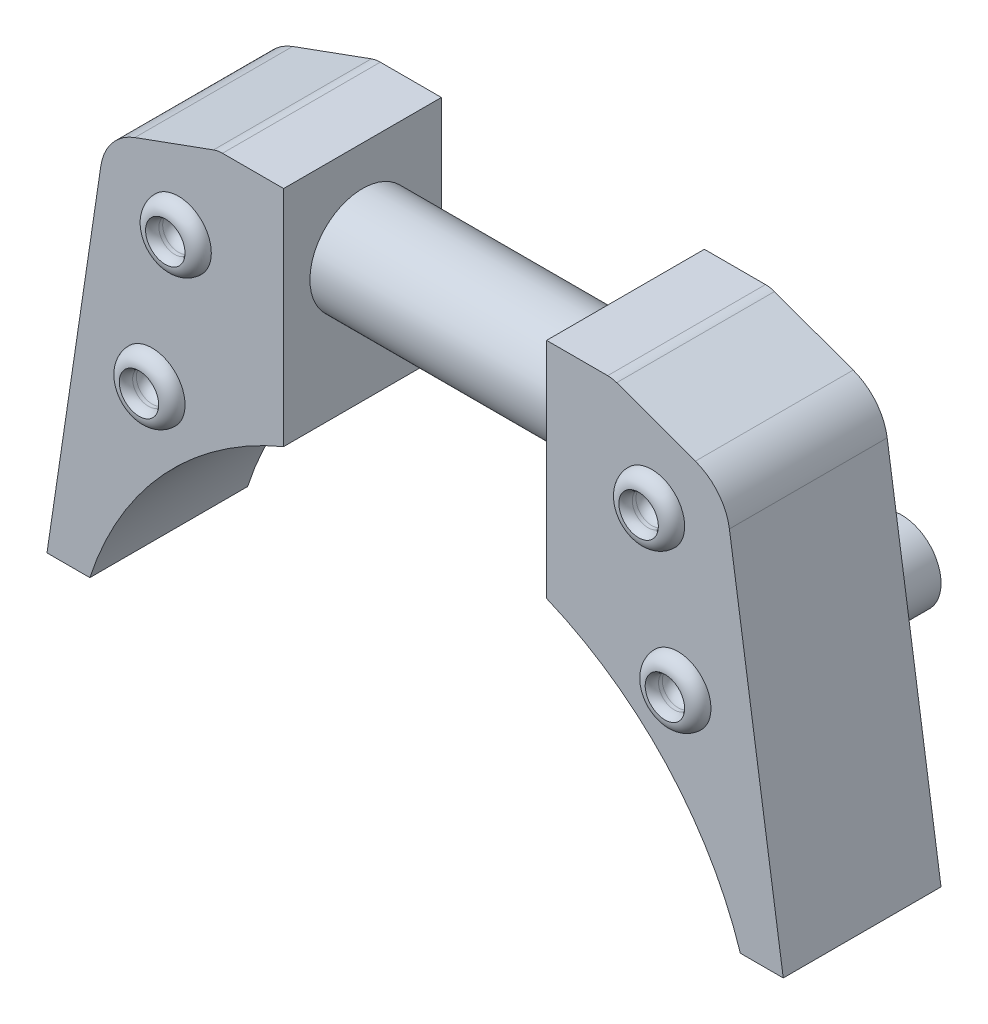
ISO-10303-21;
HEADER;
FILE_DESCRIPTION(('STEP AP214'),'2;1');
FILE_NAME('part.step','',(''),(''),'','','');
FILE_SCHEMA(('AUTOMOTIVE_DESIGN { 1 0 10303 214 1 1 1 1 }'));
ENDSEC;
DATA;
#1=APPLICATION_CONTEXT('core data for automotive mechanical design processes');
#2=APPLICATION_PROTOCOL_DEFINITION('international standard','automotive_design',2000,#1);
#3=PRODUCT_CONTEXT('',#1,'mechanical');
#4=PRODUCT('Part','Part','',(#3));
#5=PRODUCT_RELATED_PRODUCT_CATEGORY('part','',(#4));
#6=PRODUCT_DEFINITION_FORMATION('','',#4);
#7=PRODUCT_DEFINITION_CONTEXT('part definition',#1,'design');
#8=PRODUCT_DEFINITION('design','',#6,#7);
#9=PRODUCT_DEFINITION_SHAPE('','',#8);
#10=(LENGTH_UNIT() NAMED_UNIT(*) SI_UNIT(.MILLI.,.METRE.));
#11=(NAMED_UNIT(*) PLANE_ANGLE_UNIT() SI_UNIT($,.RADIAN.));
#12=(NAMED_UNIT(*) SI_UNIT($,.STERADIAN.) SOLID_ANGLE_UNIT());
#13=UNCERTAINTY_MEASURE_WITH_UNIT(LENGTH_MEASURE(1.E-05),#10,'distance_accuracy_value','');
#14=(GEOMETRIC_REPRESENTATION_CONTEXT(3) GLOBAL_UNCERTAINTY_ASSIGNED_CONTEXT((#13)) GLOBAL_UNIT_ASSIGNED_CONTEXT((#10,
#11,#12)) REPRESENTATION_CONTEXT('',''));
#15=CARTESIAN_POINT('',(0.,0.,0.));
#16=DIRECTION('',(0.,0.,1.));
#17=DIRECTION('',(1.,0.,0.));
#18=AXIS2_PLACEMENT_3D('',#15,#16,#17);
#19=CARTESIAN_POINT('',(-5.,20.5,6.));
#20=DIRECTION('',(-1.,0.,0.));
#21=DIRECTION('',(0.,-1.,0.));
#22=AXIS2_PLACEMENT_3D('',#19,#20,#21);
#23=PLANE('',#22);
#24=DIRECTION('',(0.,1.,0.));
#25=VECTOR('',#24,1.);
#26=CARTESIAN_POINT('',(-5.,20.5,0.));
#27=LINE('',#26,#25);
#28=CARTESIAN_POINT('',(-5.,12.,0.));
#29=VERTEX_POINT('',#28);
#30=CARTESIAN_POINT('',(-5.,20.5,0.));
#31=VERTEX_POINT('',#30);
#32=EDGE_CURVE('E220',#29,#31,#27,.T.);
#33=ORIENTED_EDGE('',*,*,#32,.T.);
#34=DIRECTION('',(0.,0.,-1.));
#35=VECTOR('',#34,1.);
#36=CARTESIAN_POINT('',(-5.,20.5,6.));
#37=LINE('',#36,#35);
#38=CARTESIAN_POINT('',(-5.,20.5,6.));
#39=VERTEX_POINT('',#38);
#40=EDGE_CURVE('E251',#39,#31,#37,.T.);
#41=ORIENTED_EDGE('',*,*,#40,.F.);
#42=DIRECTION('',(0.,1.,0.));
#43=VECTOR('',#42,1.);
#44=CARTESIAN_POINT('',(-5.,20.5,6.));
#45=LINE('',#44,#43);
#46=CARTESIAN_POINT('',(-5.,12.,6.));
#47=VERTEX_POINT('',#46);
#48=EDGE_CURVE('E234',#47,#39,#45,.T.);
#49=ORIENTED_EDGE('',*,*,#48,.F.);
#50=DIRECTION('',(0.,0.,-1.));
#51=VECTOR('',#50,1.);
#52=CARTESIAN_POINT('',(-5.,12.,6.));
#53=LINE('',#52,#51);
#54=EDGE_CURVE('E254',#47,#29,#53,.T.);
#55=ORIENTED_EDGE('',*,*,#54,.T.);
#56=EDGE_LOOP('',(#33,#41,#49,#55));
#57=FACE_BOUND('',#56,.T.);
#58=CARTESIAN_POINT('',(-5.,17.,3.));
#59=DIRECTION('',(-1.,0.,0.));
#60=DIRECTION('',(0.,-1.,0.));
#61=AXIS2_PLACEMENT_3D('',#58,#59,#60);
#62=CIRCLE('',#61,2.);
#63=CARTESIAN_POINT('',(-5.,15.,3.));
#64=VERTEX_POINT('',#63);
#65=EDGE_CURVE('E287',#64,#64,#62,.F.);
#66=ORIENTED_EDGE('',*,*,#65,.F.);
#67=EDGE_LOOP('',(#66));
#68=FACE_BOUND('',#67,.T.);
#69=ADVANCED_FACE('F41',(#57,#68),#23,.F.);
#70=CARTESIAN_POINT('',(0.,0.,6.));
#71=DIRECTION('',(0.,0.,1.));
#72=DIRECTION('',(1.,0.,0.));
#73=AXIS2_PLACEMENT_3D('',#70,#71,#72);
#74=PLANE('',#73);
#75=CARTESIAN_POINT('',(-10.,11.5,6.));
#76=DIRECTION('',(0.,0.,1.));
#77=DIRECTION('',(1.,0.,0.));
#78=AXIS2_PLACEMENT_3D('',#75,#76,#77);
#79=CIRCLE('',#78,1.25);
#80=CARTESIAN_POINT('',(-8.75,11.5,6.));
#81=VERTEX_POINT('',#80);
#82=EDGE_CURVE('E208',#81,#81,#79,.T.);
#83=ORIENTED_EDGE('',*,*,#82,.F.);
#84=EDGE_LOOP('',(#83));
#85=FACE_BOUND('',#84,.T.);
#86=DIRECTION('',(-1.,0.,0.));
#87=VECTOR('',#86,1.);
#88=CARTESIAN_POINT('',(-7.5,20.5,6.));
#89=LINE('',#88,#87);
#90=CARTESIAN_POINT('',(-7.32367301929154,20.5,6.));
#91=VERTEX_POINT('',#90);
#92=EDGE_CURVE('E236',#39,#91,#89,.T.);
#93=ORIENTED_EDGE('',*,*,#92,.T.);
#94=CARTESIAN_POINT('',(-7.32367301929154,19.5,6.));
#95=DIRECTION('',(0.,0.,1.));
#96=DIRECTION('',(1.,0.,0.));
#97=AXIS2_PLACEMENT_3D('',#94,#95,#96);
#98=CIRCLE('',#97,1.);
#99=CARTESIAN_POINT('',(-7.6656931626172,20.4396926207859,6.));
#100=VERTEX_POINT('',#99);
#101=EDGE_CURVE('E350',#91,#100,#98,.T.);
#102=ORIENTED_EDGE('',*,*,#101,.T.);
#103=DIRECTION('',(-0.93969262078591,-0.342020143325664,0.));
#104=VECTOR('',#103,1.);
#105=CARTESIAN_POINT('',(-7.5,20.5,6.));
#106=LINE('',#105,#104);
#107=CARTESIAN_POINT('',(-10.6579567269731,19.3505977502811,6.));
#108=VERTEX_POINT('',#107);
#109=EDGE_CURVE('E239',#100,#108,#106,.T.);
#110=ORIENTED_EDGE('',*,*,#109,.T.);
#111=CARTESIAN_POINT('',(-9.97391644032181,17.4712125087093,6.));
#112=DIRECTION('',(0.,0.,1.));
#113=DIRECTION('',(1.,0.,0.));
#114=AXIS2_PLACEMENT_3D('',#111,#112,#113);
#115=CIRCLE('',#114,2.);
#116=CARTESIAN_POINT('',(-11.9521455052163,17.7655078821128,6.));
#117=VERTEX_POINT('',#116);
#118=EDGE_CURVE('E341',#108,#117,#115,.T.);
#119=ORIENTED_EDGE('',*,*,#118,.T.);
#120=DIRECTION('',(-0.147147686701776,-0.989114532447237,0.));
#121=VECTOR('',#120,1.);
#122=CARTESIAN_POINT('',(-14.,4.,6.));
#123=LINE('',#122,#121);
#124=CARTESIAN_POINT('',(-14.,4.,6.));
#125=VERTEX_POINT('',#124);
#126=EDGE_CURVE('E241',#117,#125,#123,.T.);
#127=ORIENTED_EDGE('',*,*,#126,.T.);
#128=DIRECTION('',(1.,0.,0.));
#129=VECTOR('',#128,1.);
#130=CARTESIAN_POINT('',(-14.,4.,6.));
#131=LINE('',#130,#129);
#132=CARTESIAN_POINT('',(-12.369316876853,4.,6.));
#133=VERTEX_POINT('',#132);
#134=EDGE_CURVE('E243',#125,#133,#131,.T.);
#135=ORIENTED_EDGE('',*,*,#134,.T.);
#136=CARTESIAN_POINT('',(0.,0.,6.));
#137=DIRECTION('',(0.,0.,-1.));
#138=DIRECTION('',(1.,0.,0.));
#139=AXIS2_PLACEMENT_3D('',#136,#137,#138);
#140=CIRCLE('',#139,13.);
#141=EDGE_CURVE('E231',#133,#47,#140,.T.);
#142=ORIENTED_EDGE('',*,*,#141,.T.);
#143=ORIENTED_EDGE('',*,*,#48,.T.);
#144=EDGE_LOOP('',(#93,#102,#110,#119,#127,#135,#142,#143));
#145=FACE_BOUND('',#144,.T.);
#146=CARTESIAN_POINT('',(-9.,17.,6.));
#147=DIRECTION('',(0.,0.,1.));
#148=DIRECTION('',(1.,0.,0.));
#149=AXIS2_PLACEMENT_3D('',#146,#147,#148);
#150=CIRCLE('',#149,1.25);
#151=CARTESIAN_POINT('',(-7.75,17.,6.));
#152=VERTEX_POINT('',#151);
#153=EDGE_CURVE('E205',#152,#152,#150,.T.);
#154=ORIENTED_EDGE('',*,*,#153,.F.);
#155=EDGE_LOOP('',(#154));
#156=FACE_BOUND('',#155,.T.);
#157=ADVANCED_FACE('F379',(#85,#145,#156),#74,.T.);
#158=CARTESIAN_POINT('',(0.,0.,0.));
#159=DIRECTION('',(0.,0.,1.));
#160=DIRECTION('',(1.,0.,0.));
#161=AXIS2_PLACEMENT_3D('',#158,#159,#160);
#162=PLANE('',#161);
#163=CARTESIAN_POINT('',(-10.,11.5,0.));
#164=DIRECTION('',(0.,0.,1.));
#165=DIRECTION('',(1.,0.,0.));
#166=AXIS2_PLACEMENT_3D('',#163,#164,#165);
#167=CIRCLE('',#166,1.5);
#168=CARTESIAN_POINT('',(-8.5,11.5,0.));
#169=VERTEX_POINT('',#168);
#170=EDGE_CURVE('E257',#169,#169,#167,.F.);
#171=ORIENTED_EDGE('',*,*,#170,.F.);
#172=EDGE_LOOP('',(#171));
#173=FACE_BOUND('',#172,.T.);
#174=DIRECTION('',(-0.93969262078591,-0.342020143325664,0.));
#175=VECTOR('',#174,1.);
#176=CARTESIAN_POINT('',(-7.5,20.5,0.));
#177=LINE('',#176,#175);
#178=CARTESIAN_POINT('',(-7.6656931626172,20.4396926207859,0.));
#179=VERTEX_POINT('',#178);
#180=CARTESIAN_POINT('',(-10.6579567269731,19.3505977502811,0.));
#181=VERTEX_POINT('',#180);
#182=EDGE_CURVE('E225',#179,#181,#177,.T.);
#183=ORIENTED_EDGE('',*,*,#182,.F.);
#184=CARTESIAN_POINT('',(-7.32367301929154,19.5,0.));
#185=DIRECTION('',(0.,0.,1.));
#186=DIRECTION('',(1.,0.,0.));
#187=AXIS2_PLACEMENT_3D('',#184,#185,#186);
#188=CIRCLE('',#187,1.);
#189=CARTESIAN_POINT('',(-7.32367301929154,20.5,0.));
#190=VERTEX_POINT('',#189);
#191=EDGE_CURVE('E346',#179,#190,#188,.F.);
#192=ORIENTED_EDGE('',*,*,#191,.T.);
#193=DIRECTION('',(-1.,0.,0.));
#194=VECTOR('',#193,1.);
#195=CARTESIAN_POINT('',(-7.5,20.5,0.));
#196=LINE('',#195,#194);
#197=EDGE_CURVE('E222',#31,#190,#196,.T.);
#198=ORIENTED_EDGE('',*,*,#197,.F.);
#199=ORIENTED_EDGE('',*,*,#32,.F.);
#200=CARTESIAN_POINT('',(0.,0.,0.));
#201=DIRECTION('',(0.,0.,-1.));
#202=DIRECTION('',(1.,0.,0.));
#203=AXIS2_PLACEMENT_3D('',#200,#201,#202);
#204=CIRCLE('',#203,13.);
#205=CARTESIAN_POINT('',(-12.369316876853,4.,0.));
#206=VERTEX_POINT('',#205);
#207=EDGE_CURVE('E217',#206,#29,#204,.T.);
#208=ORIENTED_EDGE('',*,*,#207,.F.);
#209=DIRECTION('',(1.,0.,0.));
#210=VECTOR('',#209,1.);
#211=CARTESIAN_POINT('',(-14.,4.,0.));
#212=LINE('',#211,#210);
#213=CARTESIAN_POINT('',(-14.,4.,0.));
#214=VERTEX_POINT('',#213);
#215=EDGE_CURVE('E229',#214,#206,#212,.T.);
#216=ORIENTED_EDGE('',*,*,#215,.F.);
#217=DIRECTION('',(-0.147147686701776,-0.989114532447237,0.));
#218=VECTOR('',#217,1.);
#219=CARTESIAN_POINT('',(-14.,4.,0.));
#220=LINE('',#219,#218);
#221=CARTESIAN_POINT('',(-11.9521455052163,17.7655078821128,0.));
#222=VERTEX_POINT('',#221);
#223=EDGE_CURVE('E227',#222,#214,#220,.T.);
#224=ORIENTED_EDGE('',*,*,#223,.F.);
#225=CARTESIAN_POINT('',(-9.97391644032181,17.4712125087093,0.));
#226=DIRECTION('',(0.,0.,1.));
#227=DIRECTION('',(1.,0.,0.));
#228=AXIS2_PLACEMENT_3D('',#225,#226,#227);
#229=CIRCLE('',#228,2.);
#230=EDGE_CURVE('E335',#222,#181,#229,.F.);
#231=ORIENTED_EDGE('',*,*,#230,.T.);
#232=EDGE_LOOP('',(#183,#192,#198,#199,#208,#216,#224,#231));
#233=FACE_BOUND('',#232,.T.);
#234=CARTESIAN_POINT('',(-9.,17.,0.));
#235=DIRECTION('',(0.,0.,1.));
#236=DIRECTION('',(1.,0.,0.));
#237=AXIS2_PLACEMENT_3D('',#234,#235,#236);
#238=CIRCLE('',#237,1.5);
#239=CARTESIAN_POINT('',(-7.5,17.,0.));
#240=VERTEX_POINT('',#239);
#241=EDGE_CURVE('E260',#240,#240,#238,.F.);
#242=ORIENTED_EDGE('',*,*,#241,.F.);
#243=EDGE_LOOP('',(#242));
#244=FACE_BOUND('',#243,.T.);
#245=ADVANCED_FACE('F384',(#173,#233,#244),#162,.F.);
#246=CARTESIAN_POINT('',(0.,0.,6.));
#247=DIRECTION('',(0.,0.,-1.));
#248=DIRECTION('',(-1.,0.,0.));
#249=AXIS2_PLACEMENT_3D('',#246,#247,#248);
#250=CYLINDRICAL_SURFACE('',#249,13.);
#251=ORIENTED_EDGE('',*,*,#207,.T.);
#252=ORIENTED_EDGE('',*,*,#54,.F.);
#253=ORIENTED_EDGE('',*,*,#141,.F.);
#254=DIRECTION('',(0.,0.,-1.));
#255=VECTOR('',#254,1.);
#256=CARTESIAN_POINT('',(-12.369316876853,4.,6.));
#257=LINE('',#256,#255);
#258=EDGE_CURVE('E245',#133,#206,#257,.T.);
#259=ORIENTED_EDGE('',*,*,#258,.T.);
#260=EDGE_LOOP('',(#251,#252,#253,#259));
#261=FACE_BOUND('',#260,.T.);
#262=ADVANCED_FACE('F43',(#261),#250,.F.);
#263=CARTESIAN_POINT('',(-7.5,20.5,6.));
#264=DIRECTION('',(0.,-1.,0.));
#265=DIRECTION('',(0.,0.,-1.));
#266=AXIS2_PLACEMENT_3D('',#263,#264,#265);
#267=PLANE('',#266);
#268=ORIENTED_EDGE('',*,*,#197,.T.);
#269=DIRECTION('',(0.,0.,-1.));
#270=VECTOR('',#269,1.);
#271=CARTESIAN_POINT('',(-7.32367301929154,20.5,6.));
#272=LINE('',#271,#270);
#273=EDGE_CURVE('E348',#190,#91,#272,.F.);
#274=ORIENTED_EDGE('',*,*,#273,.T.);
#275=ORIENTED_EDGE('',*,*,#92,.F.);
#276=ORIENTED_EDGE('',*,*,#40,.T.);
#277=EDGE_LOOP('',(#268,#274,#275,#276));
#278=FACE_BOUND('',#277,.T.);
#279=ADVANCED_FACE('F389',(#278),#267,.F.);
#280=CARTESIAN_POINT('',(-7.5,20.5,6.));
#281=DIRECTION('',(0.342020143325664,-0.93969262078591,0.));
#282=DIRECTION('',(0.93969262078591,0.342020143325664,0.));
#283=AXIS2_PLACEMENT_3D('',#280,#281,#282);
#284=PLANE('',#283);
#285=ORIENTED_EDGE('',*,*,#109,.F.);
#286=DIRECTION('',(0.,0.,-1.));
#287=VECTOR('',#286,1.);
#288=CARTESIAN_POINT('',(-7.6656931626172,20.4396926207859,6.));
#289=LINE('',#288,#287);
#290=EDGE_CURVE('E343',#100,#179,#289,.T.);
#291=ORIENTED_EDGE('',*,*,#290,.T.);
#292=ORIENTED_EDGE('',*,*,#182,.T.);
#293=DIRECTION('',(0.,0.,-1.));
#294=VECTOR('',#293,1.);
#295=CARTESIAN_POINT('',(-10.6579567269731,19.3505977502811,6.));
#296=LINE('',#295,#294);
#297=EDGE_CURVE('E338',#181,#108,#296,.F.);
#298=ORIENTED_EDGE('',*,*,#297,.T.);
#299=EDGE_LOOP('',(#285,#291,#292,#298));
#300=FACE_BOUND('',#299,.T.);
#301=ADVANCED_FACE('F392',(#300),#284,.F.);
#302=CARTESIAN_POINT('',(-14.,4.,6.));
#303=DIRECTION('',(0.989114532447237,-0.147147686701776,0.));
#304=DIRECTION('',(0.147147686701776,0.989114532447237,0.));
#305=AXIS2_PLACEMENT_3D('',#302,#303,#304);
#306=PLANE('',#305);
#307=ORIENTED_EDGE('',*,*,#126,.F.);
#308=DIRECTION('',(0.,0.,-1.));
#309=VECTOR('',#308,1.);
#310=CARTESIAN_POINT('',(-11.9521455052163,17.7655078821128,6.));
#311=LINE('',#310,#309);
#312=EDGE_CURVE('E332',#117,#222,#311,.T.);
#313=ORIENTED_EDGE('',*,*,#312,.T.);
#314=ORIENTED_EDGE('',*,*,#223,.T.);
#315=DIRECTION('',(0.,0.,-1.));
#316=VECTOR('',#315,1.);
#317=CARTESIAN_POINT('',(-14.,4.,6.));
#318=LINE('',#317,#316);
#319=EDGE_CURVE('E248',#125,#214,#318,.T.);
#320=ORIENTED_EDGE('',*,*,#319,.F.);
#321=EDGE_LOOP('',(#307,#313,#314,#320));
#322=FACE_BOUND('',#321,.T.);
#323=ADVANCED_FACE('F396',(#322),#306,.F.);
#324=CARTESIAN_POINT('',(-14.,4.,6.));
#325=DIRECTION('',(0.,1.,0.));
#326=DIRECTION('',(0.,0.,1.));
#327=AXIS2_PLACEMENT_3D('',#324,#325,#326);
#328=PLANE('',#327);
#329=ORIENTED_EDGE('',*,*,#215,.T.);
#330=ORIENTED_EDGE('',*,*,#258,.F.);
#331=ORIENTED_EDGE('',*,*,#134,.F.);
#332=ORIENTED_EDGE('',*,*,#319,.T.);
#333=EDGE_LOOP('',(#329,#330,#331,#332));
#334=FACE_BOUND('',#333,.T.);
#335=ADVANCED_FACE('F400',(#334),#328,.F.);
#336=CARTESIAN_POINT('',(-10.,11.5,-2.5));
#337=DIRECTION('',(0.,0.,1.));
#338=DIRECTION('',(1.,0.,0.));
#339=AXIS2_PLACEMENT_3D('',#336,#337,#338);
#340=CYLINDRICAL_SURFACE('',#339,1.5);
#341=CARTESIAN_POINT('',(-10.,11.5,-2.5));
#342=DIRECTION('',(0.,0.,-1.));
#343=DIRECTION('',(-1.,0.,0.));
#344=AXIS2_PLACEMENT_3D('',#341,#342,#343);
#345=CIRCLE('',#344,1.5);
#346=CARTESIAN_POINT('',(-11.5,11.5,-2.5));
#347=VERTEX_POINT('',#346);
#348=EDGE_CURVE('E214',#347,#347,#345,.T.);
#349=ORIENTED_EDGE('',*,*,#348,.F.);
#350=EDGE_LOOP('',(#349));
#351=FACE_BOUND('',#350,.T.);
#352=ORIENTED_EDGE('',*,*,#170,.T.);
#353=EDGE_LOOP('',(#352));
#354=FACE_BOUND('',#353,.T.);
#355=ADVANCED_FACE('F403',(#351,#354),#340,.T.);
#356=CARTESIAN_POINT('',(-10.,11.5,-2.5));
#357=DIRECTION('',(0.,0.,-1.));
#358=DIRECTION('',(-1.,0.,0.));
#359=AXIS2_PLACEMENT_3D('',#356,#357,#358);
#360=PLANE('',#359);
#361=ORIENTED_EDGE('',*,*,#348,.T.);
#362=EDGE_LOOP('',(#361));
#363=FACE_BOUND('',#362,.T.);
#364=ADVANCED_FACE('F411',(#363),#360,.T.);
#365=CARTESIAN_POINT('',(-9.,17.,-1.));
#366=DIRECTION('',(0.,0.,1.));
#367=DIRECTION('',(1.,0.,0.));
#368=AXIS2_PLACEMENT_3D('',#365,#366,#367);
#369=CYLINDRICAL_SURFACE('',#368,1.5);
#370=CARTESIAN_POINT('',(-9.,17.,-1.));
#371=DIRECTION('',(0.,0.,-1.));
#372=DIRECTION('',(-1.,0.,0.));
#373=AXIS2_PLACEMENT_3D('',#370,#371,#372);
#374=CIRCLE('',#373,1.5);
#375=CARTESIAN_POINT('',(-10.5,17.,-1.));
#376=VERTEX_POINT('',#375);
#377=EDGE_CURVE('E211',#376,#376,#374,.T.);
#378=ORIENTED_EDGE('',*,*,#377,.F.);
#379=EDGE_LOOP('',(#378));
#380=FACE_BOUND('',#379,.T.);
#381=ORIENTED_EDGE('',*,*,#241,.T.);
#382=EDGE_LOOP('',(#381));
#383=FACE_BOUND('',#382,.T.);
#384=ADVANCED_FACE('F415',(#380,#383),#369,.T.);
#385=CARTESIAN_POINT('',(-9.,17.,-1.));
#386=DIRECTION('',(0.,0.,-1.));
#387=DIRECTION('',(-1.,0.,0.));
#388=AXIS2_PLACEMENT_3D('',#385,#386,#387);
#389=PLANE('',#388);
#390=ORIENTED_EDGE('',*,*,#377,.T.);
#391=EDGE_LOOP('',(#390));
#392=FACE_BOUND('',#391,.T.);
#393=ADVANCED_FACE('F419',(#392),#389,.T.);
#394=CARTESIAN_POINT('',(-9.,17.,5.5));
#395=DIRECTION('',(0.,0.,1.));
#396=DIRECTION('',(1.,0.,0.));
#397=AXIS2_PLACEMENT_3D('',#394,#395,#396);
#398=CYLINDRICAL_SURFACE('',#397,0.6);
#399=CARTESIAN_POINT('',(-9.,17.,6.14292857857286));
#400=DIRECTION('',(0.,0.,1.));
#401=DIRECTION('',(1.,0.,0.));
#402=AXIS2_PLACEMENT_3D('',#399,#400,#401);
#403=CIRCLE('',#402,0.6);
#404=CARTESIAN_POINT('',(-8.4,17.,6.14292857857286));
#405=VERTEX_POINT('',#404);
#406=EDGE_CURVE('E281',#405,#405,#403,.T.);
#407=ORIENTED_EDGE('',*,*,#406,.T.);
#408=EDGE_LOOP('',(#407));
#409=FACE_BOUND('',#408,.T.);
#410=CARTESIAN_POINT('',(-9.,17.,6.));
#411=DIRECTION('',(0.,0.,1.));
#412=DIRECTION('',(1.,0.,0.));
#413=AXIS2_PLACEMENT_3D('',#410,#411,#412);
#414=CIRCLE('',#413,0.6);
#415=CARTESIAN_POINT('',(-8.4,17.,6.));
#416=VERTEX_POINT('',#415);
#417=EDGE_CURVE('E278',#416,#416,#414,.F.);
#418=ORIENTED_EDGE('',*,*,#417,.T.);
#419=EDGE_LOOP('',(#418));
#420=FACE_BOUND('',#419,.T.);
#421=ADVANCED_FACE('F423',(#409,#420),#398,.F.);
#422=CARTESIAN_POINT('',(-9.,17.,5.5));
#423=DIRECTION('',(0.,0.,1.));
#424=DIRECTION('',(1.,0.,0.));
#425=AXIS2_PLACEMENT_3D('',#422,#423,#424);
#426=PLANE('',#425);
#427=CARTESIAN_POINT('',(-9.,17.,5.5));
#428=DIRECTION('',(0.,0.,1.));
#429=DIRECTION('',(1.,0.,0.));
#430=AXIS2_PLACEMENT_3D('',#427,#428,#429);
#431=CIRCLE('',#430,0.1);
#432=CARTESIAN_POINT('',(-8.9,17.,5.5));
#433=VERTEX_POINT('',#432);
#434=EDGE_CURVE('E284',#433,#433,#431,.T.);
#435=ORIENTED_EDGE('',*,*,#434,.T.);
#436=EDGE_LOOP('',(#435));
#437=FACE_BOUND('',#436,.T.);
#438=ADVANCED_FACE('F427',(#437),#426,.T.);
#439=CARTESIAN_POINT('',(-10.,11.5,5.5));
#440=DIRECTION('',(0.,0.,1.));
#441=DIRECTION('',(1.,0.,0.));
#442=AXIS2_PLACEMENT_3D('',#439,#440,#441);
#443=CYLINDRICAL_SURFACE('',#442,0.6);
#444=CARTESIAN_POINT('',(-10.,11.5,6.14292857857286));
#445=DIRECTION('',(0.,0.,1.));
#446=DIRECTION('',(1.,0.,0.));
#447=AXIS2_PLACEMENT_3D('',#444,#445,#446);
#448=CIRCLE('',#447,0.6);
#449=CARTESIAN_POINT('',(-9.4,11.5,6.14292857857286));
#450=VERTEX_POINT('',#449);
#451=EDGE_CURVE('E272',#450,#450,#448,.T.);
#452=ORIENTED_EDGE('',*,*,#451,.T.);
#453=EDGE_LOOP('',(#452));
#454=FACE_BOUND('',#453,.T.);
#455=CARTESIAN_POINT('',(-10.,11.5,6.));
#456=DIRECTION('',(0.,0.,1.));
#457=DIRECTION('',(1.,0.,0.));
#458=AXIS2_PLACEMENT_3D('',#455,#456,#457);
#459=CIRCLE('',#458,0.6);
#460=CARTESIAN_POINT('',(-9.4,11.5,6.));
#461=VERTEX_POINT('',#460);
#462=EDGE_CURVE('E269',#461,#461,#459,.F.);
#463=ORIENTED_EDGE('',*,*,#462,.T.);
#464=EDGE_LOOP('',(#463));
#465=FACE_BOUND('',#464,.T.);
#466=ADVANCED_FACE('F431',(#454,#465),#443,.F.);
#467=CARTESIAN_POINT('',(-10.,11.5,5.5));
#468=DIRECTION('',(0.,0.,1.));
#469=DIRECTION('',(1.,0.,0.));
#470=AXIS2_PLACEMENT_3D('',#467,#468,#469);
#471=PLANE('',#470);
#472=CARTESIAN_POINT('',(-10.,11.5,5.5));
#473=DIRECTION('',(0.,0.,1.));
#474=DIRECTION('',(1.,0.,0.));
#475=AXIS2_PLACEMENT_3D('',#472,#473,#474);
#476=CIRCLE('',#475,0.1);
#477=CARTESIAN_POINT('',(-9.9,11.5,5.5));
#478=VERTEX_POINT('',#477);
#479=EDGE_CURVE('E275',#478,#478,#476,.T.);
#480=ORIENTED_EDGE('',*,*,#479,.T.);
#481=EDGE_LOOP('',(#480));
#482=FACE_BOUND('',#481,.T.);
#483=ADVANCED_FACE('F435',(#482),#471,.T.);
#484=CARTESIAN_POINT('',(-9.,17.,6.));
#485=DIRECTION('',(0.,0.,1.));
#486=DIRECTION('',(1.,0.,0.));
#487=AXIS2_PLACEMENT_3D('',#484,#485,#486);
#488=TOROIDAL_SURFACE('',#487,0.75,0.5);
#489=ORIENTED_EDGE('',*,*,#153,.T.);
#490=EDGE_LOOP('',(#489));
#491=FACE_BOUND('',#490,.T.);
#492=CARTESIAN_POINT('',(-9.,17.,6.5));
#493=DIRECTION('',(0.,0.,1.));
#494=DIRECTION('',(1.,0.,0.));
#495=AXIS2_PLACEMENT_3D('',#492,#493,#494);
#496=CIRCLE('',#495,0.75);
#497=CARTESIAN_POINT('',(-8.25,17.,6.5));
#498=VERTEX_POINT('',#497);
#499=EDGE_CURVE('E263',#498,#498,#496,.T.);
#500=ORIENTED_EDGE('',*,*,#499,.F.);
#501=EDGE_LOOP('',(#500));
#502=FACE_BOUND('',#501,.T.);
#503=ADVANCED_FACE('F439',(#491,#502),#488,.T.);
#504=CARTESIAN_POINT('',(-10.,11.5,6.));
#505=DIRECTION('',(0.,0.,1.));
#506=DIRECTION('',(1.,0.,0.));
#507=AXIS2_PLACEMENT_3D('',#504,#505,#506);
#508=TOROIDAL_SURFACE('',#507,0.749999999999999,0.5);
#509=ORIENTED_EDGE('',*,*,#82,.T.);
#510=EDGE_LOOP('',(#509));
#511=FACE_BOUND('',#510,.T.);
#512=CARTESIAN_POINT('',(-10.,11.5,6.5));
#513=DIRECTION('',(0.,0.,1.));
#514=DIRECTION('',(1.,0.,0.));
#515=AXIS2_PLACEMENT_3D('',#512,#513,#514);
#516=CIRCLE('',#515,0.749999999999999);
#517=CARTESIAN_POINT('',(-9.25,11.5,6.5));
#518=VERTEX_POINT('',#517);
#519=EDGE_CURVE('E266',#518,#518,#516,.T.);
#520=ORIENTED_EDGE('',*,*,#519,.F.);
#521=EDGE_LOOP('',(#520));
#522=FACE_BOUND('',#521,.T.);
#523=ADVANCED_FACE('F443',(#511,#522),#508,.T.);
#524=CARTESIAN_POINT('',(-10.,11.5,6.14292857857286));
#525=DIRECTION('',(0.,0.,1.));
#526=DIRECTION('',(1.,0.,0.));
#527=AXIS2_PLACEMENT_3D('',#524,#525,#526);
#528=TOROIDAL_SURFACE('',#527,1.1,0.5);
#529=ORIENTED_EDGE('',*,*,#519,.T.);
#530=EDGE_LOOP('',(#529));
#531=FACE_BOUND('',#530,.T.);
#532=ORIENTED_EDGE('',*,*,#451,.F.);
#533=EDGE_LOOP('',(#532));
#534=FACE_BOUND('',#533,.T.);
#535=ADVANCED_FACE('F447',(#531,#534),#528,.T.);
#536=CARTESIAN_POINT('',(-10.,11.5,6.));
#537=DIRECTION('',(0.,0.,1.));
#538=DIRECTION('',(1.,0.,0.));
#539=AXIS2_PLACEMENT_3D('',#536,#537,#538);
#540=DEGENERATE_TOROIDAL_SURFACE('',#539,0.1,0.5,.T.);
#541=ORIENTED_EDGE('',*,*,#462,.F.);
#542=EDGE_LOOP('',(#541));
#543=FACE_BOUND('',#542,.T.);
#544=ORIENTED_EDGE('',*,*,#479,.F.);
#545=EDGE_LOOP('',(#544));
#546=FACE_BOUND('',#545,.T.);
#547=ADVANCED_FACE('F451',(#543,#546),#540,.F.);
#548=CARTESIAN_POINT('',(-9.,17.,6.14292857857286));
#549=DIRECTION('',(0.,0.,1.));
#550=DIRECTION('',(1.,0.,0.));
#551=AXIS2_PLACEMENT_3D('',#548,#549,#550);
#552=TOROIDAL_SURFACE('',#551,1.1,0.5);
#553=ORIENTED_EDGE('',*,*,#499,.T.);
#554=EDGE_LOOP('',(#553));
#555=FACE_BOUND('',#554,.T.);
#556=ORIENTED_EDGE('',*,*,#406,.F.);
#557=EDGE_LOOP('',(#556));
#558=FACE_BOUND('',#557,.T.);
#559=ADVANCED_FACE('F455',(#555,#558),#552,.T.);
#560=CARTESIAN_POINT('',(-9.,17.,6.));
#561=DIRECTION('',(0.,0.,1.));
#562=DIRECTION('',(1.,0.,0.));
#563=AXIS2_PLACEMENT_3D('',#560,#561,#562);
#564=DEGENERATE_TOROIDAL_SURFACE('',#563,0.1,0.5,.T.);
#565=ORIENTED_EDGE('',*,*,#417,.F.);
#566=EDGE_LOOP('',(#565));
#567=FACE_BOUND('',#566,.T.);
#568=ORIENTED_EDGE('',*,*,#434,.F.);
#569=EDGE_LOOP('',(#568));
#570=FACE_BOUND('',#569,.T.);
#571=ADVANCED_FACE('F459',(#567,#570),#564,.F.);
#572=CARTESIAN_POINT('',(7.,17.,3.));
#573=DIRECTION('',(-1.,0.,0.));
#574=DIRECTION('',(0.,-1.,0.));
#575=AXIS2_PLACEMENT_3D('',#572,#573,#574);
#576=CYLINDRICAL_SURFACE('',#575,2.);
#577=CARTESIAN_POINT('',(5.,17.,3.));
#578=DIRECTION('',(-1.,0.,0.));
#579=DIRECTION('',(0.,-1.,0.));
#580=AXIS2_PLACEMENT_3D('',#577,#578,#579);
#581=CIRCLE('',#580,2.);
#582=CARTESIAN_POINT('',(5.,15.,3.));
#583=VERTEX_POINT('',#582);
#584=EDGE_CURVE('E163',#583,#583,#581,.T.);
#585=ORIENTED_EDGE('',*,*,#584,.T.);
#586=EDGE_LOOP('',(#585));
#587=FACE_BOUND('',#586,.T.);
#588=ORIENTED_EDGE('',*,*,#65,.T.);
#589=EDGE_LOOP('',(#588));
#590=FACE_BOUND('',#589,.T.);
#591=ADVANCED_FACE('F463',(#587,#590),#576,.T.);
#592=CARTESIAN_POINT('',(5.,20.5,6.));
#593=DIRECTION('',(-1.,0.,0.));
#594=DIRECTION('',(0.,-1.,0.));
#595=AXIS2_PLACEMENT_3D('',#592,#593,#594);
#596=PLANE('',#595);
#597=DIRECTION('',(0.,1.,0.));
#598=VECTOR('',#597,1.);
#599=CARTESIAN_POINT('',(5.,20.5,0.));
#600=LINE('',#599,#598);
#601=CARTESIAN_POINT('',(5.,12.,0.));
#602=VERTEX_POINT('',#601);
#603=CARTESIAN_POINT('',(5.,20.5,0.));
#604=VERTEX_POINT('',#603);
#605=EDGE_CURVE('E186',#602,#604,#600,.T.);
#606=ORIENTED_EDGE('',*,*,#605,.F.);
#607=DIRECTION('',(0.,0.,-1.));
#608=VECTOR('',#607,1.);
#609=CARTESIAN_POINT('',(5.,12.,6.));
#610=LINE('',#609,#608);
#611=CARTESIAN_POINT('',(5.,12.,6.));
#612=VERTEX_POINT('',#611);
#613=EDGE_CURVE('E169',#612,#602,#610,.T.);
#614=ORIENTED_EDGE('',*,*,#613,.F.);
#615=DIRECTION('',(0.,1.,0.));
#616=VECTOR('',#615,1.);
#617=CARTESIAN_POINT('',(5.,20.5,6.));
#618=LINE('',#617,#616);
#619=CARTESIAN_POINT('',(5.,20.5,6.));
#620=VERTEX_POINT('',#619);
#621=EDGE_CURVE('E198',#612,#620,#618,.T.);
#622=ORIENTED_EDGE('',*,*,#621,.T.);
#623=DIRECTION('',(0.,0.,-1.));
#624=VECTOR('',#623,1.);
#625=CARTESIAN_POINT('',(5.,20.5,6.));
#626=LINE('',#625,#624);
#627=EDGE_CURVE('E202',#620,#604,#626,.T.);
#628=ORIENTED_EDGE('',*,*,#627,.T.);
#629=EDGE_LOOP('',(#606,#614,#622,#628));
#630=FACE_BOUND('',#629,.T.);
#631=ORIENTED_EDGE('',*,*,#584,.F.);
#632=EDGE_LOOP('',(#631));
#633=FACE_BOUND('',#632,.T.);
#634=ADVANCED_FACE('F363',(#630,#633),#596,.T.);
#635=CARTESIAN_POINT('',(0.,0.,6.));
#636=DIRECTION('',(0.,0.,-1.));
#637=DIRECTION('',(-1.,0.,0.));
#638=AXIS2_PLACEMENT_3D('',#635,#636,#637);
#639=CYLINDRICAL_SURFACE('',#638,13.);
#640=CARTESIAN_POINT('',(0.,0.,0.));
#641=DIRECTION('',(0.,0.,1.));
#642=DIRECTION('',(-1.,0.,0.));
#643=AXIS2_PLACEMENT_3D('',#640,#641,#642);
#644=CIRCLE('',#643,13.);
#645=CARTESIAN_POINT('',(12.369316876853,4.,0.));
#646=VERTEX_POINT('',#645);
#647=EDGE_CURVE('E167',#646,#602,#644,.T.);
#648=ORIENTED_EDGE('',*,*,#647,.F.);
#649=DIRECTION('',(0.,0.,-1.));
#650=VECTOR('',#649,1.);
#651=CARTESIAN_POINT('',(12.369316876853,4.,6.));
#652=LINE('',#651,#650);
#653=CARTESIAN_POINT('',(12.369316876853,4.,6.));
#654=VERTEX_POINT('',#653);
#655=EDGE_CURVE('E152',#654,#646,#652,.T.);
#656=ORIENTED_EDGE('',*,*,#655,.F.);
#657=CARTESIAN_POINT('',(0.,0.,6.));
#658=DIRECTION('',(0.,0.,1.));
#659=DIRECTION('',(-1.,0.,0.));
#660=AXIS2_PLACEMENT_3D('',#657,#658,#659);
#661=CIRCLE('',#660,13.);
#662=EDGE_CURVE('E188',#654,#612,#661,.T.);
#663=ORIENTED_EDGE('',*,*,#662,.T.);
#664=ORIENTED_EDGE('',*,*,#613,.T.);
#665=EDGE_LOOP('',(#648,#656,#663,#664));
#666=FACE_BOUND('',#665,.T.);
#667=ADVANCED_FACE('F168',(#666),#639,.F.);
#668=CARTESIAN_POINT('',(14.,4.,6.));
#669=DIRECTION('',(0.,-1.,0.));
#670=DIRECTION('',(0.,0.,-1.));
#671=AXIS2_PLACEMENT_3D('',#668,#669,#670);
#672=PLANE('',#671);
#673=DIRECTION('',(-1.,0.,0.));
#674=VECTOR('',#673,1.);
#675=CARTESIAN_POINT('',(14.,4.,0.));
#676=LINE('',#675,#674);
#677=CARTESIAN_POINT('',(14.,4.,0.));
#678=VERTEX_POINT('',#677);
#679=EDGE_CURVE('E157',#678,#646,#676,.T.);
#680=ORIENTED_EDGE('',*,*,#679,.F.);
#681=DIRECTION('',(0.,0.,-1.));
#682=VECTOR('',#681,1.);
#683=CARTESIAN_POINT('',(14.,4.,6.));
#684=LINE('',#683,#682);
#685=CARTESIAN_POINT('',(14.,4.,6.));
#686=VERTEX_POINT('',#685);
#687=EDGE_CURVE('E164',#686,#678,#684,.T.);
#688=ORIENTED_EDGE('',*,*,#687,.F.);
#689=DIRECTION('',(-1.,0.,0.));
#690=VECTOR('',#689,1.);
#691=CARTESIAN_POINT('',(14.,4.,6.));
#692=LINE('',#691,#690);
#693=EDGE_CURVE('E159',#686,#654,#692,.T.);
#694=ORIENTED_EDGE('',*,*,#693,.T.);
#695=ORIENTED_EDGE('',*,*,#655,.T.);
#696=EDGE_LOOP('',(#680,#688,#694,#695));
#697=FACE_BOUND('',#696,.T.);
#698=ADVANCED_FACE('F154',(#697),#672,.T.);
#699=CARTESIAN_POINT('',(14.,4.,6.));
#700=DIRECTION('',(0.989114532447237,0.147147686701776,0.));
#701=DIRECTION('',(-0.147147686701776,0.989114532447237,0.));
#702=AXIS2_PLACEMENT_3D('',#699,#700,#701);
#703=PLANE('',#702);
#704=DIRECTION('',(0.147147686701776,-0.989114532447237,0.));
#705=VECTOR('',#704,1.);
#706=CARTESIAN_POINT('',(14.,4.,0.));
#707=LINE('',#706,#705);
#708=CARTESIAN_POINT('',(11.9521455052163,17.7655078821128,0.));
#709=VERTEX_POINT('',#708);
#710=EDGE_CURVE('E176',#709,#678,#707,.T.);
#711=ORIENTED_EDGE('',*,*,#710,.F.);
#712=DIRECTION('',(0.,0.,-1.));
#713=VECTOR('',#712,1.);
#714=CARTESIAN_POINT('',(11.9521455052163,17.7655078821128,6.));
#715=LINE('',#714,#713);
#716=CARTESIAN_POINT('',(11.9521455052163,17.7655078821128,6.));
#717=VERTEX_POINT('',#716);
#718=EDGE_CURVE('E327',#709,#717,#715,.F.);
#719=ORIENTED_EDGE('',*,*,#718,.T.);
#720=DIRECTION('',(0.147147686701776,-0.989114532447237,0.));
#721=VECTOR('',#720,1.);
#722=CARTESIAN_POINT('',(14.,4.,6.));
#723=LINE('',#722,#721);
#724=EDGE_CURVE('E191',#717,#686,#723,.T.);
#725=ORIENTED_EDGE('',*,*,#724,.T.);
#726=ORIENTED_EDGE('',*,*,#687,.T.);
#727=EDGE_LOOP('',(#711,#719,#725,#726));
#728=FACE_BOUND('',#727,.T.);
#729=ADVANCED_FACE('F472',(#728),#703,.T.);
#730=CARTESIAN_POINT('',(7.5,20.5,6.));
#731=DIRECTION('',(0.342020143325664,0.93969262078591,0.));
#732=DIRECTION('',(-0.93969262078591,0.342020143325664,0.));
#733=AXIS2_PLACEMENT_3D('',#730,#731,#732);
#734=PLANE('',#733);
#735=DIRECTION('',(0.93969262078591,-0.342020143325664,0.));
#736=VECTOR('',#735,1.);
#737=CARTESIAN_POINT('',(7.5,20.5,0.));
#738=LINE('',#737,#736);
#739=CARTESIAN_POINT('',(7.6656931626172,20.4396926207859,0.));
#740=VERTEX_POINT('',#739);
#741=CARTESIAN_POINT('',(10.6579567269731,19.3505977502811,0.));
#742=VERTEX_POINT('',#741);
#743=EDGE_CURVE('E179',#740,#742,#738,.T.);
#744=ORIENTED_EDGE('',*,*,#743,.F.);
#745=DIRECTION('',(0.,0.,-1.));
#746=VECTOR('',#745,1.);
#747=CARTESIAN_POINT('',(7.6656931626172,20.4396926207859,6.));
#748=LINE('',#747,#746);
#749=CARTESIAN_POINT('',(7.6656931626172,20.4396926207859,6.));
#750=VERTEX_POINT('',#749);
#751=EDGE_CURVE('E49',#740,#750,#748,.F.);
#752=ORIENTED_EDGE('',*,*,#751,.T.);
#753=DIRECTION('',(0.93969262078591,-0.342020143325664,0.));
#754=VECTOR('',#753,1.);
#755=CARTESIAN_POINT('',(7.5,20.5,6.));
#756=LINE('',#755,#754);
#757=CARTESIAN_POINT('',(10.6579567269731,19.3505977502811,6.));
#758=VERTEX_POINT('',#757);
#759=EDGE_CURVE('E193',#750,#758,#756,.T.);
#760=ORIENTED_EDGE('',*,*,#759,.T.);
#761=DIRECTION('',(0.,0.,-1.));
#762=VECTOR('',#761,1.);
#763=CARTESIAN_POINT('',(10.6579567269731,19.3505977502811,6.));
#764=LINE('',#763,#762);
#765=EDGE_CURVE('E322',#758,#742,#764,.T.);
#766=ORIENTED_EDGE('',*,*,#765,.T.);
#767=EDGE_LOOP('',(#744,#752,#760,#766));
#768=FACE_BOUND('',#767,.T.);
#769=ADVANCED_FACE('F475',(#768),#734,.T.);
#770=CARTESIAN_POINT('',(7.5,20.5,6.));
#771=DIRECTION('',(0.,1.,0.));
#772=DIRECTION('',(0.,0.,1.));
#773=AXIS2_PLACEMENT_3D('',#770,#771,#772);
#774=PLANE('',#773);
#775=DIRECTION('',(1.,0.,0.));
#776=VECTOR('',#775,1.);
#777=CARTESIAN_POINT('',(7.5,20.5,6.));
#778=LINE('',#777,#776);
#779=CARTESIAN_POINT('',(7.32367301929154,20.5,6.));
#780=VERTEX_POINT('',#779);
#781=EDGE_CURVE('E195',#620,#780,#778,.T.);
#782=ORIENTED_EDGE('',*,*,#781,.T.);
#783=DIRECTION('',(0.,0.,-1.));
#784=VECTOR('',#783,1.);
#785=CARTESIAN_POINT('',(7.32367301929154,20.5,6.));
#786=LINE('',#785,#784);
#787=CARTESIAN_POINT('',(7.32367301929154,20.5,0.));
#788=VERTEX_POINT('',#787);
#789=EDGE_CURVE('E352',#780,#788,#786,.T.);
#790=ORIENTED_EDGE('',*,*,#789,.T.);
#791=DIRECTION('',(1.,0.,0.));
#792=VECTOR('',#791,1.);
#793=CARTESIAN_POINT('',(7.5,20.5,0.));
#794=LINE('',#793,#792);
#795=EDGE_CURVE('E184',#604,#788,#794,.T.);
#796=ORIENTED_EDGE('',*,*,#795,.F.);
#797=ORIENTED_EDGE('',*,*,#627,.F.);
#798=EDGE_LOOP('',(#782,#790,#796,#797));
#799=FACE_BOUND('',#798,.T.);
#800=ADVANCED_FACE('F358',(#799),#774,.T.);
#801=CARTESIAN_POINT('',(0.,0.,6.));
#802=DIRECTION('',(0.,0.,1.));
#803=DIRECTION('',(-1.,0.,0.));
#804=AXIS2_PLACEMENT_3D('',#801,#802,#803);
#805=PLANE('',#804);
#806=CARTESIAN_POINT('',(9.,17.,6.));
#807=DIRECTION('',(0.,0.,1.));
#808=DIRECTION('',(1.,0.,0.));
#809=AXIS2_PLACEMENT_3D('',#806,#807,#808);
#810=CIRCLE('',#809,1.25);
#811=CARTESIAN_POINT('',(10.25,17.,6.));
#812=VERTEX_POINT('',#811);
#813=EDGE_CURVE('E295',#812,#812,#810,.T.);
#814=ORIENTED_EDGE('',*,*,#813,.F.);
#815=EDGE_LOOP('',(#814));
#816=FACE_BOUND('',#815,.T.);
#817=CARTESIAN_POINT('',(10.,11.5,6.));
#818=DIRECTION('',(0.,0.,1.));
#819=DIRECTION('',(1.,0.,0.));
#820=AXIS2_PLACEMENT_3D('',#817,#818,#819);
#821=CIRCLE('',#820,1.25);
#822=CARTESIAN_POINT('',(11.25,11.5,6.));
#823=VERTEX_POINT('',#822);
#824=EDGE_CURVE('E290',#823,#823,#821,.T.);
#825=ORIENTED_EDGE('',*,*,#824,.F.);
#826=EDGE_LOOP('',(#825));
#827=FACE_BOUND('',#826,.T.);
#828=ORIENTED_EDGE('',*,*,#759,.F.);
#829=CARTESIAN_POINT('',(7.32367301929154,19.5,6.));
#830=DIRECTION('',(0.,0.,1.));
#831=DIRECTION('',(1.,0.,0.));
#832=AXIS2_PLACEMENT_3D('',#829,#830,#831);
#833=CIRCLE('',#832,1.);
#834=EDGE_CURVE('E13',#750,#780,#833,.T.);
#835=ORIENTED_EDGE('',*,*,#834,.T.);
#836=ORIENTED_EDGE('',*,*,#781,.F.);
#837=ORIENTED_EDGE('',*,*,#621,.F.);
#838=ORIENTED_EDGE('',*,*,#662,.F.);
#839=ORIENTED_EDGE('',*,*,#693,.F.);
#840=ORIENTED_EDGE('',*,*,#724,.F.);
#841=CARTESIAN_POINT('',(9.97391644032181,17.4712125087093,6.));
#842=DIRECTION('',(0.,0.,1.));
#843=DIRECTION('',(1.,0.,0.));
#844=AXIS2_PLACEMENT_3D('',#841,#842,#843);
#845=CIRCLE('',#844,2.);
#846=EDGE_CURVE('E329',#717,#758,#845,.T.);
#847=ORIENTED_EDGE('',*,*,#846,.T.);
#848=EDGE_LOOP('',(#828,#835,#836,#837,#838,#839,#840,#847));
#849=FACE_BOUND('',#848,.T.);
#850=ADVANCED_FACE('F367',(#816,#827,#849),#805,.T.);
#851=CARTESIAN_POINT('',(0.,0.,0.));
#852=DIRECTION('',(0.,0.,1.));
#853=DIRECTION('',(-1.,0.,0.));
#854=AXIS2_PLACEMENT_3D('',#851,#852,#853);
#855=PLANE('',#854);
#856=CARTESIAN_POINT('',(9.,17.,0.));
#857=DIRECTION('',(0.,0.,1.));
#858=DIRECTION('',(1.,0.,0.));
#859=AXIS2_PLACEMENT_3D('',#856,#857,#858);
#860=CIRCLE('',#859,1.5);
#861=CARTESIAN_POINT('',(10.5,17.,0.));
#862=VERTEX_POINT('',#861);
#863=EDGE_CURVE('E906',#862,#862,#860,.T.);
#864=ORIENTED_EDGE('',*,*,#863,.T.);
#865=EDGE_LOOP('',(#864));
#866=FACE_BOUND('',#865,.T.);
#867=CARTESIAN_POINT('',(10.,11.5,0.));
#868=DIRECTION('',(0.,0.,1.));
#869=DIRECTION('',(1.,0.,0.));
#870=AXIS2_PLACEMENT_3D('',#867,#868,#869);
#871=CIRCLE('',#870,1.5);
#872=CARTESIAN_POINT('',(11.5,11.5,0.));
#873=VERTEX_POINT('',#872);
#874=EDGE_CURVE('E905',#873,#873,#871,.T.);
#875=ORIENTED_EDGE('',*,*,#874,.T.);
#876=EDGE_LOOP('',(#875));
#877=FACE_BOUND('',#876,.T.);
#878=ORIENTED_EDGE('',*,*,#795,.T.);
#879=CARTESIAN_POINT('',(7.32367301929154,19.5,0.));
#880=DIRECTION('',(0.,0.,1.));
#881=DIRECTION('',(1.,0.,0.));
#882=AXIS2_PLACEMENT_3D('',#879,#880,#881);
#883=CIRCLE('',#882,1.);
#884=EDGE_CURVE('E63',#788,#740,#883,.F.);
#885=ORIENTED_EDGE('',*,*,#884,.T.);
#886=ORIENTED_EDGE('',*,*,#743,.T.);
#887=CARTESIAN_POINT('',(9.97391644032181,17.4712125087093,0.));
#888=DIRECTION('',(0.,0.,1.));
#889=DIRECTION('',(1.,0.,0.));
#890=AXIS2_PLACEMENT_3D('',#887,#888,#889);
#891=CIRCLE('',#890,2.);
#892=EDGE_CURVE('E325',#742,#709,#891,.F.);
#893=ORIENTED_EDGE('',*,*,#892,.T.);
#894=ORIENTED_EDGE('',*,*,#710,.T.);
#895=ORIENTED_EDGE('',*,*,#679,.T.);
#896=ORIENTED_EDGE('',*,*,#647,.T.);
#897=ORIENTED_EDGE('',*,*,#605,.T.);
#898=EDGE_LOOP('',(#878,#885,#886,#893,#894,#895,#896,#897));
#899=FACE_BOUND('',#898,.T.);
#900=ADVANCED_FACE('F174',(#866,#877,#899),#855,.F.);
#901=CARTESIAN_POINT('',(10.,11.5,-2.5));
#902=DIRECTION('',(0.,0.,1.));
#903=DIRECTION('',(1.,0.,0.));
#904=AXIS2_PLACEMENT_3D('',#901,#902,#903);
#905=CYLINDRICAL_SURFACE('',#904,1.5);
#906=CARTESIAN_POINT('',(10.,11.5,-2.5));
#907=DIRECTION('',(0.,0.,1.));
#908=DIRECTION('',(1.,0.,0.));
#909=AXIS2_PLACEMENT_3D('',#906,#907,#908);
#910=CIRCLE('',#909,1.5);
#911=CARTESIAN_POINT('',(11.5,11.5,-2.5));
#912=VERTEX_POINT('',#911);
#913=EDGE_CURVE('E172',#912,#912,#910,.T.);
#914=ORIENTED_EDGE('',*,*,#913,.T.);
#915=EDGE_LOOP('',(#914));
#916=FACE_BOUND('',#915,.T.);
#917=ORIENTED_EDGE('',*,*,#874,.F.);
#918=EDGE_LOOP('',(#917));
#919=FACE_BOUND('',#918,.T.);
#920=ADVANCED_FACE('F488',(#916,#919),#905,.T.);
#921=CARTESIAN_POINT('',(10.,11.5,-2.5));
#922=DIRECTION('',(0.,0.,-1.));
#923=DIRECTION('',(1.,0.,0.));
#924=AXIS2_PLACEMENT_3D('',#921,#922,#923);
#925=PLANE('',#924);
#926=ORIENTED_EDGE('',*,*,#913,.F.);
#927=EDGE_LOOP('',(#926));
#928=FACE_BOUND('',#927,.T.);
#929=ADVANCED_FACE('F492',(#928),#925,.T.);
#930=CARTESIAN_POINT('',(9.,17.,-1.));
#931=DIRECTION('',(0.,0.,1.));
#932=DIRECTION('',(1.,0.,0.));
#933=AXIS2_PLACEMENT_3D('',#930,#931,#932);
#934=CYLINDRICAL_SURFACE('',#933,1.5);
#935=CARTESIAN_POINT('',(9.,17.,-1.));
#936=DIRECTION('',(0.,0.,1.));
#937=DIRECTION('',(1.,0.,0.));
#938=AXIS2_PLACEMENT_3D('',#935,#936,#937);
#939=CIRCLE('',#938,1.5);
#940=CARTESIAN_POINT('',(10.5,17.,-1.));
#941=VERTEX_POINT('',#940);
#942=EDGE_CURVE('E904',#941,#941,#939,.T.);
#943=ORIENTED_EDGE('',*,*,#942,.T.);
#944=EDGE_LOOP('',(#943));
#945=FACE_BOUND('',#944,.T.);
#946=ORIENTED_EDGE('',*,*,#863,.F.);
#947=EDGE_LOOP('',(#946));
#948=FACE_BOUND('',#947,.T.);
#949=ADVANCED_FACE('F496',(#945,#948),#934,.T.);
#950=CARTESIAN_POINT('',(9.,17.,-1.));
#951=DIRECTION('',(0.,0.,-1.));
#952=DIRECTION('',(1.,0.,0.));
#953=AXIS2_PLACEMENT_3D('',#950,#951,#952);
#954=PLANE('',#953);
#955=ORIENTED_EDGE('',*,*,#942,.F.);
#956=EDGE_LOOP('',(#955));
#957=FACE_BOUND('',#956,.T.);
#958=ADVANCED_FACE('F500',(#957),#954,.T.);
#959=CARTESIAN_POINT('',(9.,17.,5.5));
#960=DIRECTION('',(0.,0.,1.));
#961=DIRECTION('',(1.,0.,0.));
#962=AXIS2_PLACEMENT_3D('',#959,#960,#961);
#963=CYLINDRICAL_SURFACE('',#962,0.6);
#964=CARTESIAN_POINT('',(9.,17.,6.14292857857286));
#965=DIRECTION('',(0.,0.,1.));
#966=DIRECTION('',(1.,0.,0.));
#967=AXIS2_PLACEMENT_3D('',#964,#965,#966);
#968=CIRCLE('',#967,0.6);
#969=CARTESIAN_POINT('',(9.6,17.,6.14292857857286));
#970=VERTEX_POINT('',#969);
#971=EDGE_CURVE('E316',#970,#970,#968,.T.);
#972=ORIENTED_EDGE('',*,*,#971,.T.);
#973=EDGE_LOOP('',(#972));
#974=FACE_BOUND('',#973,.T.);
#975=CARTESIAN_POINT('',(9.,17.,6.));
#976=DIRECTION('',(0.,0.,1.));
#977=DIRECTION('',(1.,0.,0.));
#978=AXIS2_PLACEMENT_3D('',#975,#976,#977);
#979=CIRCLE('',#978,0.6);
#980=CARTESIAN_POINT('',(9.6,17.,6.));
#981=VERTEX_POINT('',#980);
#982=EDGE_CURVE('E313',#981,#981,#979,.F.);
#983=ORIENTED_EDGE('',*,*,#982,.T.);
#984=EDGE_LOOP('',(#983));
#985=FACE_BOUND('',#984,.T.);
#986=ADVANCED_FACE('F504',(#974,#985),#963,.F.);
#987=CARTESIAN_POINT('',(9.,17.,5.5));
#988=DIRECTION('',(0.,0.,1.));
#989=DIRECTION('',(-1.,0.,0.));
#990=AXIS2_PLACEMENT_3D('',#987,#988,#989);
#991=PLANE('',#990);
#992=CARTESIAN_POINT('',(9.,17.,5.5));
#993=DIRECTION('',(0.,0.,1.));
#994=DIRECTION('',(1.,0.,0.));
#995=AXIS2_PLACEMENT_3D('',#992,#993,#994);
#996=CIRCLE('',#995,0.1);
#997=CARTESIAN_POINT('',(9.1,17.,5.5));
#998=VERTEX_POINT('',#997);
#999=EDGE_CURVE('E319',#998,#998,#996,.T.);
#1000=ORIENTED_EDGE('',*,*,#999,.T.);
#1001=EDGE_LOOP('',(#1000));
#1002=FACE_BOUND('',#1001,.T.);
#1003=ADVANCED_FACE('F508',(#1002),#991,.T.);
#1004=CARTESIAN_POINT('',(10.,11.5,5.5));
#1005=DIRECTION('',(0.,0.,1.));
#1006=DIRECTION('',(1.,0.,0.));
#1007=AXIS2_PLACEMENT_3D('',#1004,#1005,#1006);
#1008=CYLINDRICAL_SURFACE('',#1007,0.6);
#1009=CARTESIAN_POINT('',(10.,11.5,6.14292857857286));
#1010=DIRECTION('',(0.,0.,1.));
#1011=DIRECTION('',(1.,0.,0.));
#1012=AXIS2_PLACEMENT_3D('',#1009,#1010,#1011);
#1013=CIRCLE('',#1012,0.6);
#1014=CARTESIAN_POINT('',(10.6,11.5,6.14292857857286));
#1015=VERTEX_POINT('',#1014);
#1016=EDGE_CURVE('E307',#1015,#1015,#1013,.T.);
#1017=ORIENTED_EDGE('',*,*,#1016,.T.);
#1018=EDGE_LOOP('',(#1017));
#1019=FACE_BOUND('',#1018,.T.);
#1020=CARTESIAN_POINT('',(10.,11.5,6.));
#1021=DIRECTION('',(0.,0.,1.));
#1022=DIRECTION('',(1.,0.,0.));
#1023=AXIS2_PLACEMENT_3D('',#1020,#1021,#1022);
#1024=CIRCLE('',#1023,0.6);
#1025=CARTESIAN_POINT('',(10.6,11.5,6.));
#1026=VERTEX_POINT('',#1025);
#1027=EDGE_CURVE('E304',#1026,#1026,#1024,.F.);
#1028=ORIENTED_EDGE('',*,*,#1027,.T.);
#1029=EDGE_LOOP('',(#1028));
#1030=FACE_BOUND('',#1029,.T.);
#1031=ADVANCED_FACE('F512',(#1019,#1030),#1008,.F.);
#1032=CARTESIAN_POINT('',(10.,11.5,5.5));
#1033=DIRECTION('',(0.,0.,1.));
#1034=DIRECTION('',(-1.,0.,0.));
#1035=AXIS2_PLACEMENT_3D('',#1032,#1033,#1034);
#1036=PLANE('',#1035);
#1037=CARTESIAN_POINT('',(10.,11.5,5.5));
#1038=DIRECTION('',(0.,0.,1.));
#1039=DIRECTION('',(1.,0.,0.));
#1040=AXIS2_PLACEMENT_3D('',#1037,#1038,#1039);
#1041=CIRCLE('',#1040,0.1);
#1042=CARTESIAN_POINT('',(10.1,11.5,5.5));
#1043=VERTEX_POINT('',#1042);
#1044=EDGE_CURVE('E310',#1043,#1043,#1041,.T.);
#1045=ORIENTED_EDGE('',*,*,#1044,.T.);
#1046=EDGE_LOOP('',(#1045));
#1047=FACE_BOUND('',#1046,.T.);
#1048=ADVANCED_FACE('F516',(#1047),#1036,.T.);
#1049=CARTESIAN_POINT('',(9.,17.,6.));
#1050=DIRECTION('',(0.,0.,1.));
#1051=DIRECTION('',(1.,0.,0.));
#1052=AXIS2_PLACEMENT_3D('',#1049,#1050,#1051);
#1053=TOROIDAL_SURFACE('',#1052,0.75,0.5);
#1054=CARTESIAN_POINT('',(9.,17.,6.5));
#1055=DIRECTION('',(0.,0.,1.));
#1056=DIRECTION('',(1.,0.,0.));
#1057=AXIS2_PLACEMENT_3D('',#1054,#1055,#1056);
#1058=CIRCLE('',#1057,0.75);
#1059=CARTESIAN_POINT('',(9.75,17.,6.5));
#1060=VERTEX_POINT('',#1059);
#1061=EDGE_CURVE('E298',#1060,#1060,#1058,.T.);
#1062=ORIENTED_EDGE('',*,*,#1061,.F.);
#1063=EDGE_LOOP('',(#1062));
#1064=FACE_BOUND('',#1063,.T.);
#1065=ORIENTED_EDGE('',*,*,#813,.T.);
#1066=EDGE_LOOP('',(#1065));
#1067=FACE_BOUND('',#1066,.T.);
#1068=ADVANCED_FACE('F520',(#1064,#1067),#1053,.T.);
#1069=CARTESIAN_POINT('',(10.,11.5,6.));
#1070=DIRECTION('',(0.,0.,1.));
#1071=DIRECTION('',(1.,0.,0.));
#1072=AXIS2_PLACEMENT_3D('',#1069,#1070,#1071);
#1073=TOROIDAL_SURFACE('',#1072,0.749999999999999,0.5);
#1074=CARTESIAN_POINT('',(10.,11.5,6.5));
#1075=DIRECTION('',(0.,0.,1.));
#1076=DIRECTION('',(1.,0.,0.));
#1077=AXIS2_PLACEMENT_3D('',#1074,#1075,#1076);
#1078=CIRCLE('',#1077,0.749999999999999);
#1079=CARTESIAN_POINT('',(10.75,11.5,6.5));
#1080=VERTEX_POINT('',#1079);
#1081=EDGE_CURVE('E301',#1080,#1080,#1078,.T.);
#1082=ORIENTED_EDGE('',*,*,#1081,.F.);
#1083=EDGE_LOOP('',(#1082));
#1084=FACE_BOUND('',#1083,.T.);
#1085=ORIENTED_EDGE('',*,*,#824,.T.);
#1086=EDGE_LOOP('',(#1085));
#1087=FACE_BOUND('',#1086,.T.);
#1088=ADVANCED_FACE('F524',(#1084,#1087),#1073,.T.);
#1089=CARTESIAN_POINT('',(10.,11.5,6.14292857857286));
#1090=DIRECTION('',(0.,0.,1.));
#1091=DIRECTION('',(1.,0.,0.));
#1092=AXIS2_PLACEMENT_3D('',#1089,#1090,#1091);
#1093=TOROIDAL_SURFACE('',#1092,1.1,0.5);
#1094=ORIENTED_EDGE('',*,*,#1016,.F.);
#1095=EDGE_LOOP('',(#1094));
#1096=FACE_BOUND('',#1095,.T.);
#1097=ORIENTED_EDGE('',*,*,#1081,.T.);
#1098=EDGE_LOOP('',(#1097));
#1099=FACE_BOUND('',#1098,.T.);
#1100=ADVANCED_FACE('F528',(#1096,#1099),#1093,.T.);
#1101=CARTESIAN_POINT('',(10.,11.5,6.));
#1102=DIRECTION('',(0.,0.,1.));
#1103=DIRECTION('',(1.,0.,0.));
#1104=AXIS2_PLACEMENT_3D('',#1101,#1102,#1103);
#1105=DEGENERATE_TOROIDAL_SURFACE('',#1104,0.1,0.5,.T.);
#1106=ORIENTED_EDGE('',*,*,#1044,.F.);
#1107=EDGE_LOOP('',(#1106));
#1108=FACE_BOUND('',#1107,.T.);
#1109=ORIENTED_EDGE('',*,*,#1027,.F.);
#1110=EDGE_LOOP('',(#1109));
#1111=FACE_BOUND('',#1110,.T.);
#1112=ADVANCED_FACE('F532',(#1108,#1111),#1105,.F.);
#1113=CARTESIAN_POINT('',(9.,17.,6.14292857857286));
#1114=DIRECTION('',(0.,0.,1.));
#1115=DIRECTION('',(1.,0.,0.));
#1116=AXIS2_PLACEMENT_3D('',#1113,#1114,#1115);
#1117=TOROIDAL_SURFACE('',#1116,1.1,0.5);
#1118=ORIENTED_EDGE('',*,*,#971,.F.);
#1119=EDGE_LOOP('',(#1118));
#1120=FACE_BOUND('',#1119,.T.);
#1121=ORIENTED_EDGE('',*,*,#1061,.T.);
#1122=EDGE_LOOP('',(#1121));
#1123=FACE_BOUND('',#1122,.T.);
#1124=ADVANCED_FACE('F536',(#1120,#1123),#1117,.T.);
#1125=CARTESIAN_POINT('',(9.,17.,6.));
#1126=DIRECTION('',(0.,0.,1.));
#1127=DIRECTION('',(1.,0.,0.));
#1128=AXIS2_PLACEMENT_3D('',#1125,#1126,#1127);
#1129=DEGENERATE_TOROIDAL_SURFACE('',#1128,0.1,0.5,.T.);
#1130=ORIENTED_EDGE('',*,*,#999,.F.);
#1131=EDGE_LOOP('',(#1130));
#1132=FACE_BOUND('',#1131,.T.);
#1133=ORIENTED_EDGE('',*,*,#982,.F.);
#1134=EDGE_LOOP('',(#1133));
#1135=FACE_BOUND('',#1134,.T.);
#1136=ADVANCED_FACE('F540',(#1132,#1135),#1129,.F.);
#1137=CARTESIAN_POINT('',(9.97391644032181,17.4712125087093,6.));
#1138=DIRECTION('',(0.,0.,-1.));
#1139=DIRECTION('',(-1.,0.,0.));
#1140=AXIS2_PLACEMENT_3D('',#1137,#1138,#1139);
#1141=CYLINDRICAL_SURFACE('',#1140,2.);
#1142=ORIENTED_EDGE('',*,*,#846,.F.);
#1143=ORIENTED_EDGE('',*,*,#718,.F.);
#1144=ORIENTED_EDGE('',*,*,#892,.F.);
#1145=ORIENTED_EDGE('',*,*,#765,.F.);
#1146=EDGE_LOOP('',(#1142,#1143,#1144,#1145));
#1147=FACE_BOUND('',#1146,.T.);
#1148=ADVANCED_FACE('F544',(#1147),#1141,.T.);
#1149=CARTESIAN_POINT('',(-9.97391644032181,17.4712125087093,6.));
#1150=DIRECTION('',(0.,0.,-1.));
#1151=DIRECTION('',(-1.,0.,0.));
#1152=AXIS2_PLACEMENT_3D('',#1149,#1150,#1151);
#1153=CYLINDRICAL_SURFACE('',#1152,2.);
#1154=ORIENTED_EDGE('',*,*,#118,.F.);
#1155=ORIENTED_EDGE('',*,*,#297,.F.);
#1156=ORIENTED_EDGE('',*,*,#230,.F.);
#1157=ORIENTED_EDGE('',*,*,#312,.F.);
#1158=EDGE_LOOP('',(#1154,#1155,#1156,#1157));
#1159=FACE_BOUND('',#1158,.T.);
#1160=ADVANCED_FACE('F375',(#1159),#1153,.T.);
#1161=CARTESIAN_POINT('',(-7.32367301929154,19.5,6.));
#1162=DIRECTION('',(0.,0.,-1.));
#1163=DIRECTION('',(-1.,0.,0.));
#1164=AXIS2_PLACEMENT_3D('',#1161,#1162,#1163);
#1165=CYLINDRICAL_SURFACE('',#1164,1.);
#1166=ORIENTED_EDGE('',*,*,#101,.F.);
#1167=ORIENTED_EDGE('',*,*,#273,.F.);
#1168=ORIENTED_EDGE('',*,*,#191,.F.);
#1169=ORIENTED_EDGE('',*,*,#290,.F.);
#1170=EDGE_LOOP('',(#1166,#1167,#1168,#1169));
#1171=FACE_BOUND('',#1170,.T.);
#1172=ADVANCED_FACE('F370',(#1171),#1165,.T.);
#1173=CARTESIAN_POINT('',(7.32367301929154,19.5,6.));
#1174=DIRECTION('',(0.,0.,-1.));
#1175=DIRECTION('',(-1.,0.,0.));
#1176=AXIS2_PLACEMENT_3D('',#1173,#1174,#1175);
#1177=CYLINDRICAL_SURFACE('',#1176,1.);
#1178=ORIENTED_EDGE('',*,*,#834,.F.);
#1179=ORIENTED_EDGE('',*,*,#751,.F.);
#1180=ORIENTED_EDGE('',*,*,#884,.F.);
#1181=ORIENTED_EDGE('',*,*,#789,.F.);
#1182=EDGE_LOOP('',(#1178,#1179,#1180,#1181));
#1183=FACE_BOUND('',#1182,.T.);
#1184=ADVANCED_FACE('F368',(#1183),#1177,.T.);
#1185=CLOSED_SHELL('',(#69,#157,#245,#262,#279,#301,#323,#335,#355,#364,#384,#393,#421,#438,
#466,#483,#503,#523,#535,#547,#559,#571,#591,#634,#667,#698,#729,#769,#800,#850,#900,#920,#929,
#949,#958,#986,#1003,#1031,#1048,#1068,#1088,#1100,#1112,#1124,#1136,#1148,#1160,#1172,#1184));
#1186=MANIFOLD_SOLID_BREP('B2',#1185);
#1187=ADVANCED_BREP_SHAPE_REPRESENTATION('',(#18,#1186),#14);
#1188=SHAPE_DEFINITION_REPRESENTATION(#9,#1187);
ENDSEC;
END-ISO-10303-21;
